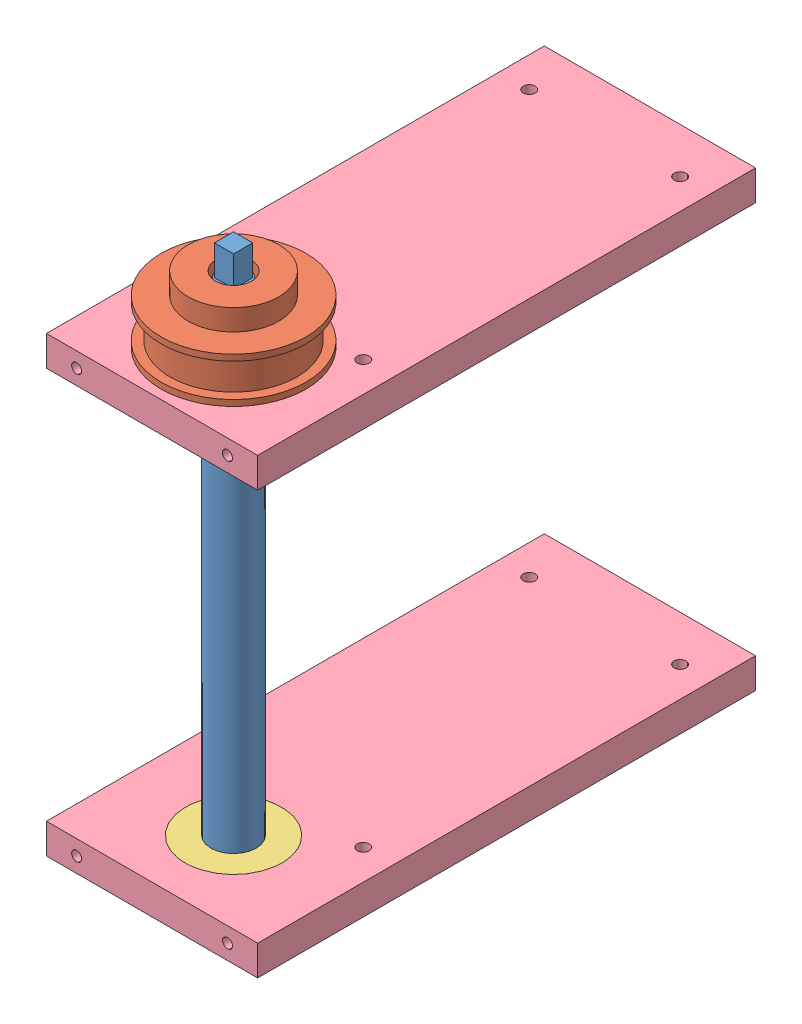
SolidWorks assembly Z-Husillo con apollos.SLDASM, configuration Predeterminado (file format 3800). Lengths in mm.
Overall size (70 180 165).
8 component instances, 4 part files, 0 mates.
Components (placement in the parent):
- Z-Husillo-1: Z-Husillo.SLDPRT [Predeterminado] at (0 10 0) x (1 0 0) z (0 1 0) size (15 15 180)
- Z-Polea (26 XL 037)-1: Z-Polea (26 XL 037).SLDPRT [Predeterminado] at (0 150 0) size (48 22 48)
- Z-rodamiento con soporte-1: Z-rodamiento con soporte.SLDASM [Predeterminado] x (1 0 0) z (0 1 0) size (70 165 10)
  - Z-rodamiento (7201.2RS.TVP)-1: Z-rodamiento (7201.2RS.TVP).SLDPRT [Predeterminado] at origin size (32 32 10)
  - Z-Soporte rodamiento-1: Z-Soporte rodamiento.SLDPRT [Predeterminado] at origin size (70 165 10)
- Z-rodamiento con soporte-2: Z-rodamiento con soporte.SLDASM [Predeterminado] at (0 150 0) x (-1 0 0) z (0 -1 0) size (70 165 10)
  - Z-rodamiento (7201.2RS.TVP)-1: Z-rodamiento (7201.2RS.TVP).SLDPRT [Predeterminado] at origin size (32 32 10)
  - Z-Soporte rodamiento-1: Z-Soporte rodamiento.SLDPRT [Predeterminado] at origin size (70 165 10)
